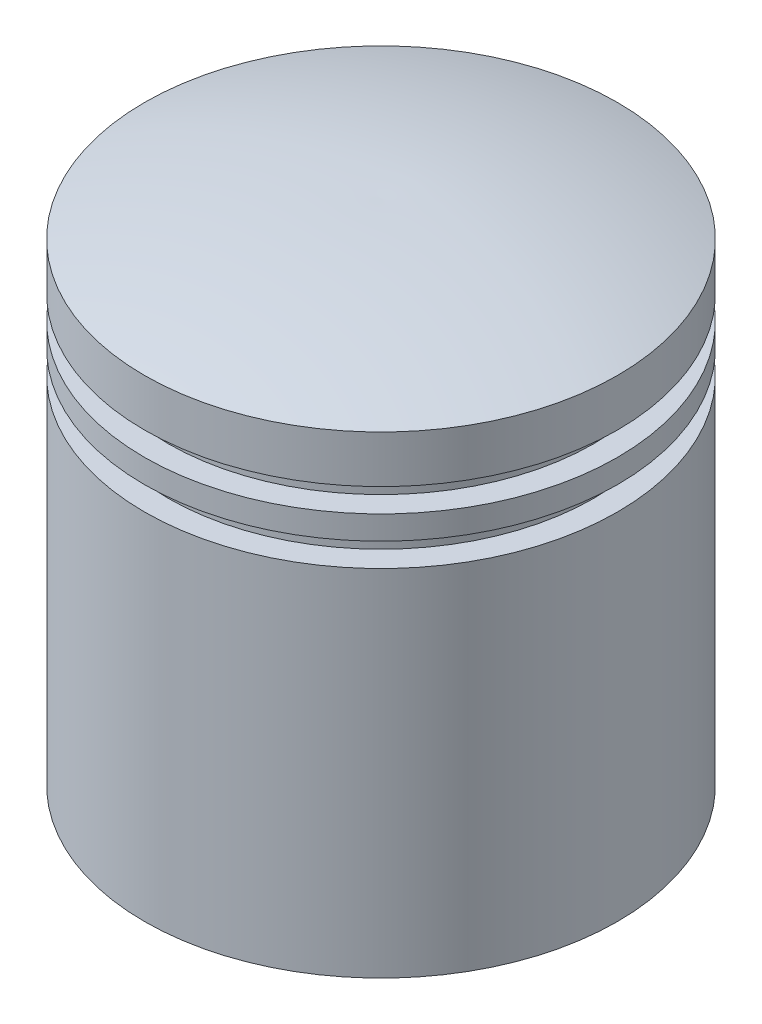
from build123d import *


with BuildPart() as part:
    # Sketch1 → Revolve1 (revolve)
    with BuildSketch(Plane.XY, mode=Mode.PRIVATE) as revolve1_sk:
        with BuildLine():
            Line((25.4, 0), (25.4, 38.1))
            Line((25.4, 38.1), (22.86, 38.1))
            Line((22.86, 38.1), (22.86, 40.64))
            Line((22.86, 40.64), (25.4, 40.64))
            Line((25.4, 40.64), (25.4, 43.18))
            Line((25.4, 43.18), (22.86, 43.18))
            Line((22.86, 43.18), (22.86, 45.72))
            Line((22.86, 45.72), (25.4, 45.72))
            Line((25.4, 45.72), (25.4, 50.8))
            ThreePointArc((25.4, 50.8), (12.86168233, 53.782882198), (0, 54.61))
            Line((0, 54.61), (0, 44.45))
            Line((0, 44.45), (15.875, 44.45))
            Line((15.875, 44.45), (15.875, 19.05))
            Line((15.875, 19.05), (20.955, 19.05))
            Line((20.955, 19.05), (20.955, 0))
            Line((20.955, 0), (25.4, 0))
        make_face()
    revolve(revolve1_sk.sketch.rotate(Axis((0, 0, 0), (0, 1, 0)), 90), axis=Axis((0, 0, 0), (0, 1, 0)))


solid = part.part
